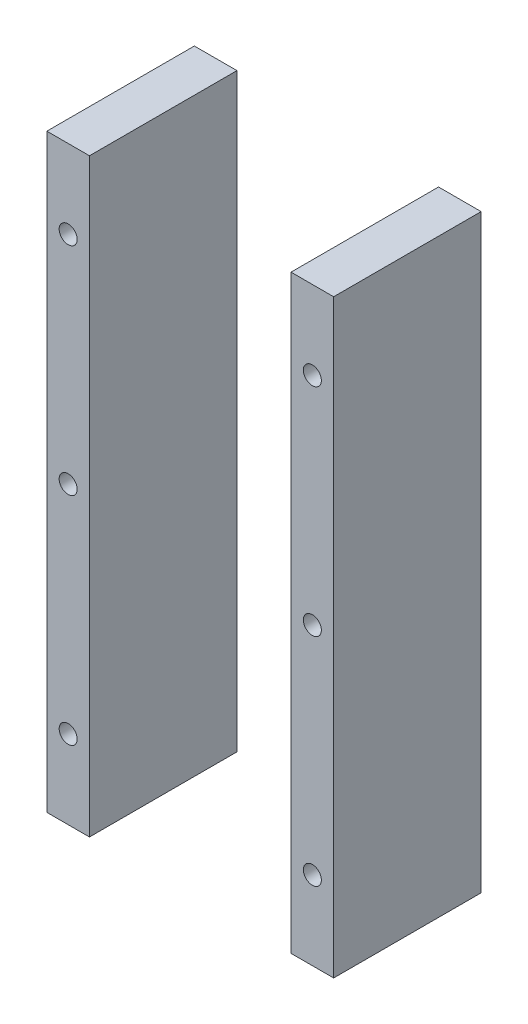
from build123d import *

# Parameters (mm, degrees)
CROQUIS1_W                = 26
CROQUIS1_H                = 360
SALIENTE_EXTRUIR1_DEPTH   = 90
SALIENTE_EXTRUIR1_2_DEPTH = 90
CROQUIS2_R                = 5.5
CORTAR_EXTRUIR1_DEPTH     = 259.348601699


with BuildPart() as part:
    # Croquis1 → Saliente-Extruir1 (new body)
    with BuildSketch(Plane.XY):
        Rectangle(CROQUIS1_W, CROQUIS1_H)
    extrude(amount=SALIENTE_EXTRUIR1_DEPTH)


with BuildPart() as body_2:
    # Croquis1 → Saliente-Extruir1 2 (new body)
    with BuildSketch(Plane.XY):
        with Locations((149, 0)):
            Rectangle(CROQUIS1_W, CROQUIS1_H)
    extrude(amount=SALIENTE_EXTRUIR1_2_DEPTH)


with BuildPart() as cortar_extruir1_tool:
    # Croquis2 → Cortar-Extruir1 (new, through all)
    with BuildSketch(Plane.XY.offset(90)):
        with Locations((0, 132)):
            Circle(CROQUIS2_R)
        Circle(CROQUIS2_R)
        with Locations((0, -132)):
            Circle(CROQUIS2_R)
        with Locations((149, -132)):
            Circle(CROQUIS2_R)
        with Locations((149, 0)):
            Circle(CROQUIS2_R)
        with Locations((149, 132)):
            Circle(CROQUIS2_R)
    extrude(amount=-CORTAR_EXTRUIR1_DEPTH)


with BuildPart() as part_1:
    add(part.part)

    # Cortar-Extruir1: cut by cortar_extruir1_tool
    add(cortar_extruir1_tool.part, mode=Mode.SUBTRACT)


with BuildPart() as body_2_1:
    add(body_2.part)

    # Cortar-Extruir1: cut by cortar_extruir1_tool
    add(cortar_extruir1_tool.part, mode=Mode.SUBTRACT)


solid = Compound([part_1.part, body_2_1.part])
